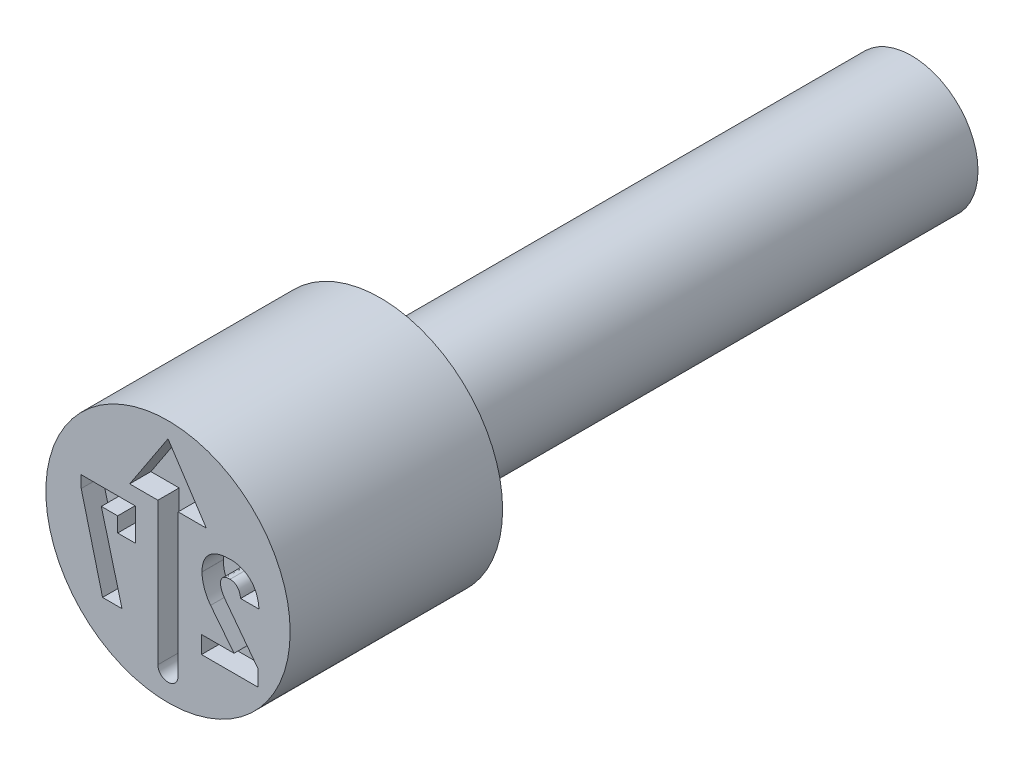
from build123d import *

# Parameters (mm, degrees)
CUT_EXTRUDE4_DEPTH = 0.4
CUT_EXTRUDE5_DEPTH = 0.4


with BuildPart() as part:
    # Sketch2 → Revolve1 (revolve)
    with BuildSketch(Plane(origin=(0, 0, 0), x_dir=(0, 0, -1), z_dir=(1, 0, 0)), mode=Mode.PRIVATE) as revolve1_sk:
        Polygon((0, 2.3), (0, 0), (14, 0), (14, 1.25), (4, 1.25), (4, 2.3), align=None)
    revolve(revolve1_sk.sketch.rotate(Axis((0, 0, -0.403888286), (0, 0, -1)), 90), axis=Axis((0, 0, -0.403888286), (0, 0, -1)))

    # Sketch3 → Cut-Extrude4 (cut)
    with BuildSketch(Plane.XY):
        with BuildLine():
            Line((0.190473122, 0.906351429), (0.190473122, -1.776161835))
            ThreePointArc((0.190473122, -1.776161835), (0, -1.966634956), (-0.190473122, -1.776161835))
            Line((-0.190473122, -1.776161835), (-0.190473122, 0.906351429))
            Line((-0.190473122, 0.906351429), (-0.721917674, 0.906351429))
            Line((-0.721917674, 0.906351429), (0, 2.002115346))
            Line((0, 2.002115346), (0.721917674, 0.906351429))
            Line((0.721917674, 0.906351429), (0.190473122, 0.906351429))
        make_face()
    extrude(amount=-CUT_EXTRUDE4_DEPTH, mode=Mode.SUBTRACT)

    # Sketch4 → Cut-Extrude5 (cut)
    with BuildSketch(Plane.XY):
        with BuildLine():
            Line((1.69085301, -1.2), (1.69085301, -0.893912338))
            Line((1.69085301, -0.893912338), (1.075755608, -0.079017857))
            add(Edge.make_bspline(
                [(1.075755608, -0.079017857), (1.062872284, -0.060864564), (1.03776952, -0.025493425), (1.015049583, 0.023081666), (1.000896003, 0.061165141), (0.994150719, 0.088783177), (0.989338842, 0.115133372), (0.988746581, 0.132447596), (0.98845853, 0.140868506)],
                knots=[0, 0, 0, 0, 1.664252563, 3.24274559, 3.998498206, 4.704056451, 5.369707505, 6, 6, 6, 6], degree=3))
            Line((0.98845853, 0.140868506), (0.98845853, 0.143425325))
            add(Edge.make_bspline(
                [(0.98845853, 0.143425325), (0.988957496, 0.154934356), (0.989913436, 0.176983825), (0.998919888, 0.20805196), (1.013680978, 0.23510756), (1.034822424, 0.257455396), (1.061141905, 0.27513119), (1.092633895, 0.287588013), (1.128886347, 0.294731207), (1.154618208, 0.29563044), (1.168166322, 0.296103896)],
                knots=[0, 0, 0, 0, 1.029992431, 1.973301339, 2.872554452, 3.768620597, 4.704316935, 5.693697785, 6.785705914, 8, 8, 8, 8], degree=3))
            add(Edge.make_bspline(
                [(1.168166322, 0.296103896), (1.181398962, 0.295587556), (1.207110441, 0.294584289), (1.243509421, 0.283465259), (1.276308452, 0.266024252), (1.304583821, 0.241138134), (1.327997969, 0.209892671), (1.347000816, 0.17309857), (1.359907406, 0.130091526), (1.364472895, 0.099305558), (1.366867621, 0.083157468)],
                knots=[0, 0, 0, 0, 0.980828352, 1.905783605, 2.800718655, 3.724477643, 4.680224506, 5.688112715, 6.78735127, 8, 8, 8, 8], degree=3))
            Line((1.366867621, 0.083157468), (1.366867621, 0.082061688))
            Line((1.366867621, 0.082061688), (1.713133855, 0.082061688))
            Line((1.713133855, 0.082061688), (1.713133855, 0.083157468))
            add(Edge.make_bspline(
                [(1.713133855, 0.083157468), (1.711425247, 0.104022), (1.70809008, 0.144749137), (1.697155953, 0.203662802), (1.683024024, 0.259155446), (1.665046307, 0.311216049), (1.641944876, 0.35924181), (1.615989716, 0.404236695), (1.584772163, 0.444809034), (1.550600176, 0.482316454), (1.512538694, 0.515352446), (1.471954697, 0.544494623), (1.42823449, 0.568745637), (1.382042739, 0.588863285), (1.332867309, 0.604132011), (1.281350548, 0.61556945), (1.22690114, 0.622165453), (1.18973429, 0.622966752), (1.17072314, 0.623376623)],
                knots=[0, 0, 0, 0, 1.173229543, 2.290119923, 3.354877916, 4.382703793, 5.372196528, 6.339367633, 7.289741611, 8.236749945, 9.180232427, 10.11040526, 11.033485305, 11.978374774, 12.930610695, 13.916256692, 14.93414813, 16, 16, 16, 16], degree=3))
            add(Edge.make_bspline(
                [(1.17072314, 0.623376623), (1.150252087, 0.62308583), (1.110438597, 0.622520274), (1.052477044, 0.61641528), (0.997941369, 0.607201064), (0.946919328, 0.593721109), (0.899615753, 0.576137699), (0.855888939, 0.554936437), (0.81564748, 0.529936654), (0.779199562, 0.501084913), (0.746405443, 0.468905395), (0.718178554, 0.433071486), (0.693743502, 0.394307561), (0.674642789, 0.351861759), (0.658917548, 0.306732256), (0.648735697, 0.25811011), (0.641874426, 0.20656779), (0.64111835, 0.171087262), (0.640731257, 0.152922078)],
                knots=[0, 0, 0, 0, 1.219700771, 2.37215663, 3.469774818, 4.513610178, 5.512457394, 6.473141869, 7.405450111, 8.330272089, 9.238546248, 10.1372905, 11.043445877, 11.962355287, 12.905558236, 13.886315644, 14.917844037, 16, 16, 16, 16], degree=3))
            Line((0.640731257, 0.152922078), (0.640731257, 0.151461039))
            add(Edge.make_bspline(
                [(0.640731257, 0.151461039), (0.641196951, 0.130980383), (0.642129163, 0.089982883), (0.650543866, 0.028624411), (0.664103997, -0.0324208), (0.682726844, -0.092857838), (0.705861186, -0.151639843), (0.733626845, -0.207961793), (0.764963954, -0.261848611), (0.789795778, -0.29510689), (0.802176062, -0.311688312)],
                knots=[0, 0, 0, 0, 0.984368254, 1.970475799, 2.971844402, 3.988480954, 5.008197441, 6.005725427, 7.005724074, 8, 8, 8, 8], degree=3))
            Line((0.802176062, -0.311688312), (1.243409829, -0.872727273))
            Line((1.243409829, -0.872727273), (0.630869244, -0.872727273))
            Line((0.630869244, -0.872727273), (0.630869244, -1.2))
            Line((0.630869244, -1.2), (1.69085301, -1.2))
        make_face()
        Polygon((-1.633755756, 0.6), (-1.633755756, 0.374269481), (-1.231970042, -1.2), (-0.865979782, -1.2), (-1.255346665, 0.272727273), (-0.947432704, 0.272727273), (-0.947432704, -0.007792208), (-0.609567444, -0.007792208), (-0.609567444, 0.6), align=None)
    extrude(amount=-CUT_EXTRUDE5_DEPTH, mode=Mode.SUBTRACT)


solid = part.part
